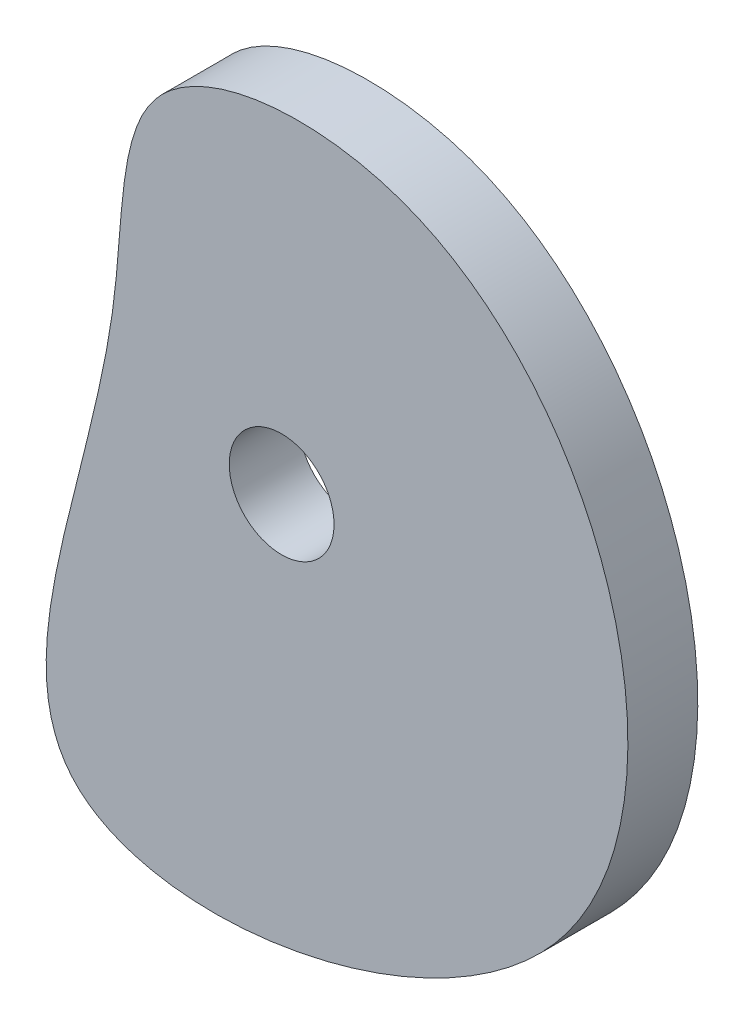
ISO-10303-21;
HEADER;
FILE_DESCRIPTION(('STEP AP214'),'2;1');
FILE_NAME('part.step','',(''),(''),'','','');
FILE_SCHEMA(('AUTOMOTIVE_DESIGN { 1 0 10303 214 1 1 1 1 }'));
ENDSEC;
DATA;
#1=APPLICATION_CONTEXT('core data for automotive mechanical design processes');
#2=APPLICATION_PROTOCOL_DEFINITION('international standard','automotive_design',2000,#1);
#3=PRODUCT_CONTEXT('',#1,'mechanical');
#4=PRODUCT('Part','Part','',(#3));
#5=PRODUCT_RELATED_PRODUCT_CATEGORY('part','',(#4));
#6=PRODUCT_DEFINITION_FORMATION('','',#4);
#7=PRODUCT_DEFINITION_CONTEXT('part definition',#1,'design');
#8=PRODUCT_DEFINITION('design','',#6,#7);
#9=PRODUCT_DEFINITION_SHAPE('','',#8);
#10=(LENGTH_UNIT() NAMED_UNIT(*) SI_UNIT(.MILLI.,.METRE.));
#11=(NAMED_UNIT(*) PLANE_ANGLE_UNIT() SI_UNIT($,.RADIAN.));
#12=(NAMED_UNIT(*) SI_UNIT($,.STERADIAN.) SOLID_ANGLE_UNIT());
#13=UNCERTAINTY_MEASURE_WITH_UNIT(LENGTH_MEASURE(1.E-05),#10,'distance_accuracy_value','');
#14=(GEOMETRIC_REPRESENTATION_CONTEXT(3) GLOBAL_UNCERTAINTY_ASSIGNED_CONTEXT((#13)) GLOBAL_UNIT_ASSIGNED_CONTEXT((#10,
#11,#12)) REPRESENTATION_CONTEXT('',''));
#15=CARTESIAN_POINT('',(0.,0.,0.));
#16=DIRECTION('',(0.,0.,1.));
#17=DIRECTION('',(1.,0.,0.));
#18=AXIS2_PLACEMENT_3D('',#15,#16,#17);
#19=CARTESIAN_POINT('',(18.9341777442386,-50.3851903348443,5.));
#20=DIRECTION('',(0.,0.,1.));
#21=DIRECTION('',(1.,0.,0.));
#22=AXIS2_PLACEMENT_3D('',#19,#20,#21);
#23=PLANE('',#22);
#24=CARTESIAN_POINT('',(-18.,40.,5.));
#25=CARTESIAN_POINT('',(-23.3167441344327,33.5957681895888,5.));
#26=CARTESIAN_POINT('',(-21.087526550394,0.135304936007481,5.));
#27=CARTESIAN_POINT('',(-54.7183799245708,-69.0398101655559,5.));
#28=CARTESIAN_POINT('',(71.1154098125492,-48.4726449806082,5.));
#29=CARTESIAN_POINT('',(41.3605918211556,53.2933354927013,5.));
#30=CARTESIAN_POINT('',(-11.4356180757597,47.9070616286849,5.));
#31=CARTESIAN_POINT('',(-18.,40.,5.));
#32=B_SPLINE_CURVE_WITH_KNOTS('',3,(#24,#25,#26,#27,#28,#29,#30,#31),.UNSPECIFIED.,.T.,.F.,(4,1,
1,1,1,4),(0.,0.101866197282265,0.323450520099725,0.578116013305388,0.874229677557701,1.),.UNSPECIFIED.);
#33=CARTESIAN_POINT('',(-18.,40.,5.));
#34=VERTEX_POINT('',#33);
#35=EDGE_CURVE('E10',#34,#34,#32,.T.);
#36=ORIENTED_EDGE('',*,*,#35,.T.);
#37=EDGE_LOOP('',(#36));
#38=FACE_BOUND('',#37,.T.);
#39=CARTESIAN_POINT('',(0.,0.,5.));
#40=DIRECTION('',(0.,0.,1.));
#41=DIRECTION('',(1.,0.,0.));
#42=AXIS2_PLACEMENT_3D('',#39,#40,#41);
#43=CIRCLE('',#42,7.5);
#44=CARTESIAN_POINT('',(7.5,0.,5.));
#45=VERTEX_POINT('',#44);
#46=EDGE_CURVE('E45',#45,#45,#43,.T.);
#47=ORIENTED_EDGE('',*,*,#46,.F.);
#48=EDGE_LOOP('',(#47));
#49=FACE_BOUND('',#48,.T.);
#50=ADVANCED_FACE('F31',(#38,#49),#23,.T.);
#51=CARTESIAN_POINT('',(18.9341777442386,-50.3851903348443,-5.));
#52=DIRECTION('',(0.,0.,1.));
#53=DIRECTION('',(1.,0.,0.));
#54=AXIS2_PLACEMENT_3D('',#51,#52,#53);
#55=PLANE('',#54);
#56=CARTESIAN_POINT('',(-18.,40.,-5.));
#57=CARTESIAN_POINT('',(-23.3167441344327,33.5957681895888,-5.));
#58=CARTESIAN_POINT('',(-21.087526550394,0.135304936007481,-5.));
#59=CARTESIAN_POINT('',(-54.7183799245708,-69.0398101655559,-5.));
#60=CARTESIAN_POINT('',(71.1154098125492,-48.4726449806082,-5.));
#61=CARTESIAN_POINT('',(41.3605918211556,53.2933354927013,-5.));
#62=CARTESIAN_POINT('',(-11.4356180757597,47.9070616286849,-5.));
#63=CARTESIAN_POINT('',(-18.,40.,-5.));
#64=B_SPLINE_CURVE_WITH_KNOTS('',3,(#56,#57,#58,#59,#60,#61,#62,#63),.UNSPECIFIED.,.T.,.F.,(4,1,
1,1,1,4),(0.,0.101866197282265,0.323450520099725,0.578116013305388,0.874229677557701,1.),.UNSPECIFIED.);
#65=CARTESIAN_POINT('',(-18.,40.,-5.));
#66=VERTEX_POINT('',#65);
#67=EDGE_CURVE('E41',#66,#66,#64,.T.);
#68=ORIENTED_EDGE('',*,*,#67,.F.);
#69=EDGE_LOOP('',(#68));
#70=FACE_BOUND('',#69,.T.);
#71=CARTESIAN_POINT('',(0.,0.,-5.));
#72=DIRECTION('',(0.,0.,1.));
#73=DIRECTION('',(1.,0.,0.));
#74=AXIS2_PLACEMENT_3D('',#71,#72,#73);
#75=CIRCLE('',#74,7.5);
#76=CARTESIAN_POINT('',(7.5,0.,-5.));
#77=VERTEX_POINT('',#76);
#78=EDGE_CURVE('E49',#77,#77,#75,.T.);
#79=ORIENTED_EDGE('',*,*,#78,.T.);
#80=EDGE_LOOP('',(#79));
#81=FACE_BOUND('',#80,.T.);
#82=ADVANCED_FACE('F60',(#70,#81),#55,.F.);
#83=DIRECTION('',(0.,0.,-1.));
#84=VECTOR('',#83,1.);
#85=SURFACE_OF_LINEAR_EXTRUSION('',#32,#84);
#86=ORIENTED_EDGE('',*,*,#35,.F.);
#87=EDGE_LOOP('',(#86));
#88=FACE_BOUND('',#87,.T.);
#89=ORIENTED_EDGE('',*,*,#67,.T.);
#90=EDGE_LOOP('',(#89));
#91=FACE_BOUND('',#90,.T.);
#92=ADVANCED_FACE('F33',(#88,#91),#85,.F.);
#93=CARTESIAN_POINT('',(0.,0.,5.));
#94=DIRECTION('',(0.,0.,-1.));
#95=DIRECTION('',(-1.,0.,0.));
#96=AXIS2_PLACEMENT_3D('',#93,#94,#95);
#97=CYLINDRICAL_SURFACE('',#96,7.5);
#98=ORIENTED_EDGE('',*,*,#46,.T.);
#99=EDGE_LOOP('',(#98));
#100=FACE_BOUND('',#99,.T.);
#101=ORIENTED_EDGE('',*,*,#78,.F.);
#102=EDGE_LOOP('',(#101));
#103=FACE_BOUND('',#102,.T.);
#104=ADVANCED_FACE('F62',(#100,#103),#97,.F.);
#105=CLOSED_SHELL('',(#50,#82,#92,#104));
#106=MANIFOLD_SOLID_BREP('B2',#105);
#107=ADVANCED_BREP_SHAPE_REPRESENTATION('',(#18,#106),#14);
#108=SHAPE_DEFINITION_REPRESENTATION(#9,#107);
ENDSEC;
END-ISO-10303-21;
